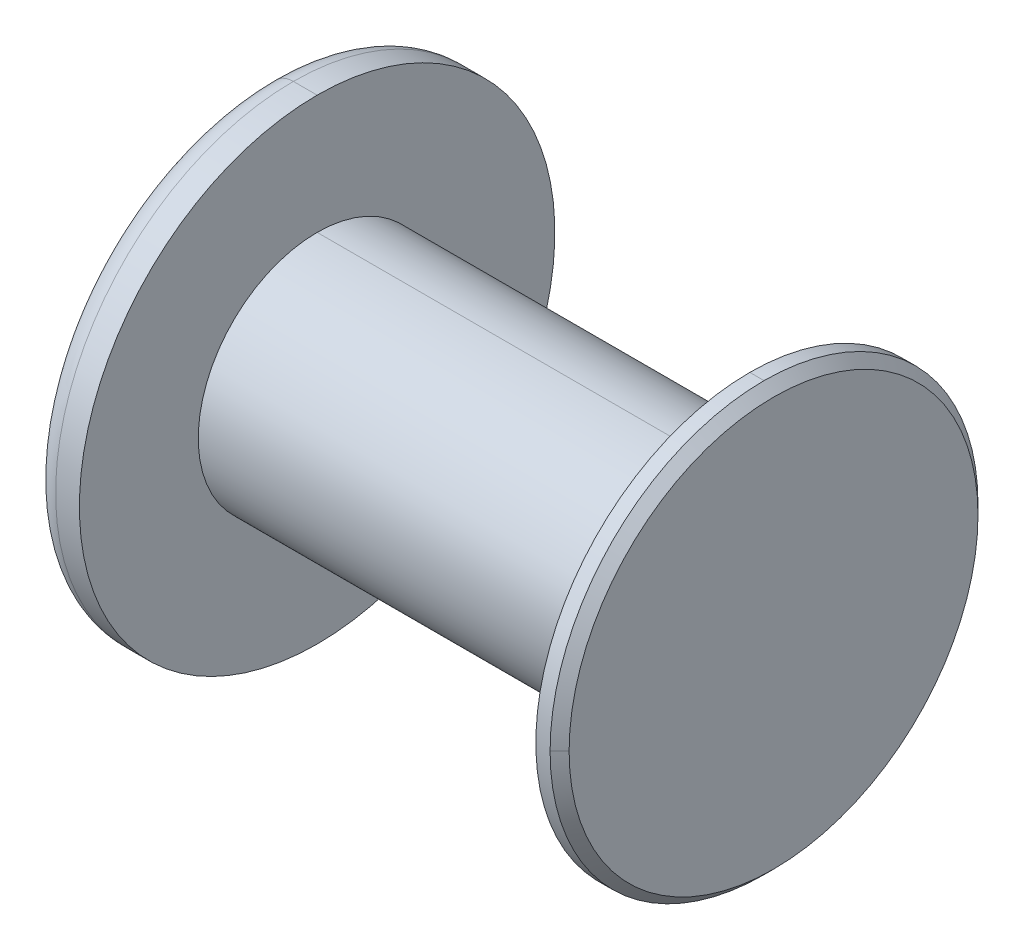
ISO-10303-21;
HEADER;
FILE_DESCRIPTION(('STEP AP214'),'2;1');
FILE_NAME('part.step','',(''),(''),'','','');
FILE_SCHEMA(('AUTOMOTIVE_DESIGN { 1 0 10303 214 1 1 1 1 }'));
ENDSEC;
DATA;
#1=APPLICATION_CONTEXT('core data for automotive mechanical design processes');
#2=APPLICATION_PROTOCOL_DEFINITION('international standard','automotive_design',2000,#1);
#3=PRODUCT_CONTEXT('',#1,'mechanical');
#4=PRODUCT('Part','Part','',(#3));
#5=PRODUCT_RELATED_PRODUCT_CATEGORY('part','',(#4));
#6=PRODUCT_DEFINITION_FORMATION('','',#4);
#7=PRODUCT_DEFINITION_CONTEXT('part definition',#1,'design');
#8=PRODUCT_DEFINITION('design','',#6,#7);
#9=PRODUCT_DEFINITION_SHAPE('','',#8);
#10=(LENGTH_UNIT() NAMED_UNIT(*) SI_UNIT(.MILLI.,.METRE.));
#11=(NAMED_UNIT(*) PLANE_ANGLE_UNIT() SI_UNIT($,.RADIAN.));
#12=(NAMED_UNIT(*) SI_UNIT($,.STERADIAN.) SOLID_ANGLE_UNIT());
#13=UNCERTAINTY_MEASURE_WITH_UNIT(LENGTH_MEASURE(1.E-05),#10,'distance_accuracy_value','');
#14=(GEOMETRIC_REPRESENTATION_CONTEXT(3) GLOBAL_UNCERTAINTY_ASSIGNED_CONTEXT((#13)) GLOBAL_UNIT_ASSIGNED_CONTEXT((#10,
#11,#12)) REPRESENTATION_CONTEXT('',''));
#15=CARTESIAN_POINT('',(0.,0.,0.));
#16=DIRECTION('',(0.,0.,1.));
#17=DIRECTION('',(1.,0.,0.));
#18=AXIS2_PLACEMENT_3D('',#15,#16,#17);
#19=CARTESIAN_POINT('',(5.1,0.,0.));
#20=DIRECTION('',(-1.,0.,0.));
#21=DIRECTION('',(0.,0.,1.));
#22=AXIS2_PLACEMENT_3D('',#19,#20,#21);
#23=CONICAL_SURFACE('',#22,4.5,0.785398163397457);
#24=DIRECTION('',(-0.707106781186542,0.,-0.707106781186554));
#25=VECTOR('',#24,1.);
#26=CARTESIAN_POINT('',(5.1,0.,-4.5));
#27=LINE('',#26,#25);
#28=CARTESIAN_POINT('',(5.3,0.,-4.3));
#29=VERTEX_POINT('',#28);
#30=CARTESIAN_POINT('',(5.1,0.,-4.5));
#31=VERTEX_POINT('',#30);
#32=EDGE_CURVE('E157',#29,#31,#27,.T.);
#33=ORIENTED_EDGE('',*,*,#32,.F.);
#34=CARTESIAN_POINT('',(5.3,0.,0.));
#35=DIRECTION('',(1.,0.,0.));
#36=DIRECTION('',(0.,-1.,0.));
#37=AXIS2_PLACEMENT_3D('',#34,#35,#36);
#38=CIRCLE('',#37,4.3);
#39=CARTESIAN_POINT('',(5.3,0.,4.3));
#40=VERTEX_POINT('',#39);
#41=EDGE_CURVE('E166',#40,#29,#38,.T.);
#42=ORIENTED_EDGE('',*,*,#41,.F.);
#43=DIRECTION('',(-0.707106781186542,0.,0.707106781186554));
#44=VECTOR('',#43,1.);
#45=CARTESIAN_POINT('',(5.1,0.,4.5));
#46=LINE('',#45,#44);
#47=CARTESIAN_POINT('',(5.1,0.,4.5));
#48=VERTEX_POINT('',#47);
#49=EDGE_CURVE('E156',#40,#48,#46,.T.);
#50=ORIENTED_EDGE('',*,*,#49,.T.);
#51=CARTESIAN_POINT('',(5.1,0.,0.));
#52=DIRECTION('',(-1.,0.,0.));
#53=DIRECTION('',(0.,0.,1.));
#54=AXIS2_PLACEMENT_3D('',#51,#52,#53);
#55=CIRCLE('',#54,4.5);
#56=CARTESIAN_POINT('',(5.1,-4.5,0.));
#57=VERTEX_POINT('',#56);
#58=EDGE_CURVE('E134',#57,#48,#55,.T.);
#59=ORIENTED_EDGE('',*,*,#58,.F.);
#60=CARTESIAN_POINT('',(5.1,0.,0.));
#61=DIRECTION('',(-1.,0.,0.));
#62=DIRECTION('',(0.,0.,1.));
#63=AXIS2_PLACEMENT_3D('',#60,#61,#62);
#64=CIRCLE('',#63,4.5);
#65=EDGE_CURVE('E11',#31,#57,#64,.T.);
#66=ORIENTED_EDGE('',*,*,#65,.F.);
#67=EDGE_LOOP('',(#33,#42,#50,#59,#66));
#68=FACE_BOUND('',#67,.T.);
#69=ADVANCED_FACE('F17',(#68),#23,.T.);
#70=CARTESIAN_POINT('',(-4.8,0.,0.));
#71=DIRECTION('',(1.,0.,0.));
#72=DIRECTION('',(0.,1.,0.));
#73=AXIS2_PLACEMENT_3D('',#70,#71,#72);
#74=TOROIDAL_SURFACE('',#73,4.5,0.5);
#75=CARTESIAN_POINT('',(-4.8,-4.5,0.));
#76=DIRECTION('',(0.,0.,1.));
#77=DIRECTION('',(0.,-1.,0.));
#78=AXIS2_PLACEMENT_3D('',#75,#76,#77);
#79=CIRCLE('',#78,0.5);
#80=CARTESIAN_POINT('',(-5.3,-4.5,0.));
#81=VERTEX_POINT('',#80);
#82=CARTESIAN_POINT('',(-4.8,-5.,0.));
#83=VERTEX_POINT('',#82);
#84=EDGE_CURVE('E155',#81,#83,#79,.T.);
#85=ORIENTED_EDGE('',*,*,#84,.F.);
#86=CARTESIAN_POINT('',(-5.3,0.,0.));
#87=DIRECTION('',(-1.,0.,0.));
#88=DIRECTION('',(0.,1.,0.));
#89=AXIS2_PLACEMENT_3D('',#86,#87,#88);
#90=CIRCLE('',#89,4.5);
#91=CARTESIAN_POINT('',(-5.3,4.5,0.));
#92=VERTEX_POINT('',#91);
#93=EDGE_CURVE('E163',#92,#81,#90,.T.);
#94=ORIENTED_EDGE('',*,*,#93,.F.);
#95=CARTESIAN_POINT('',(-4.8,4.5,0.));
#96=DIRECTION('',(0.,0.,-1.));
#97=DIRECTION('',(-1.,0.,0.));
#98=AXIS2_PLACEMENT_3D('',#95,#96,#97);
#99=CIRCLE('',#98,0.5);
#100=CARTESIAN_POINT('',(-4.8,5.,0.));
#101=VERTEX_POINT('',#100);
#102=EDGE_CURVE('E140',#92,#101,#99,.T.);
#103=ORIENTED_EDGE('',*,*,#102,.T.);
#104=CARTESIAN_POINT('',(-4.8,0.,0.));
#105=DIRECTION('',(1.,0.,0.));
#106=DIRECTION('',(0.,1.,0.));
#107=AXIS2_PLACEMENT_3D('',#104,#105,#106);
#108=CIRCLE('',#107,5.);
#109=EDGE_CURVE('E206',#83,#101,#108,.T.);
#110=ORIENTED_EDGE('',*,*,#109,.F.);
#111=EDGE_LOOP('',(#85,#94,#103,#110));
#112=FACE_BOUND('',#111,.T.);
#113=ADVANCED_FACE('F205',(#112),#74,.T.);
#114=CARTESIAN_POINT('',(-5.3,0.,0.));
#115=DIRECTION('',(-1.,0.,0.));
#116=DIRECTION('',(0.,-1.,0.));
#117=AXIS2_PLACEMENT_3D('',#114,#115,#116);
#118=CYLINDRICAL_SURFACE('',#117,4.5);
#119=DIRECTION('',(-1.,0.,0.));
#120=VECTOR('',#119,1.);
#121=CARTESIAN_POINT('',(-5.3,4.5,0.));
#122=LINE('',#121,#120);
#123=CARTESIAN_POINT('',(5.1,4.5,0.));
#124=VERTEX_POINT('',#123);
#125=CARTESIAN_POINT('',(4.8,4.5,0.));
#126=VERTEX_POINT('',#125);
#127=EDGE_CURVE('E117',#124,#126,#122,.T.);
#128=ORIENTED_EDGE('',*,*,#127,.F.);
#129=CARTESIAN_POINT('',(5.1,0.,0.));
#130=DIRECTION('',(-1.,0.,0.));
#131=DIRECTION('',(0.,0.,1.));
#132=AXIS2_PLACEMENT_3D('',#129,#130,#131);
#133=CIRCLE('',#132,4.5);
#134=EDGE_CURVE('E161',#124,#31,#133,.T.);
#135=ORIENTED_EDGE('',*,*,#134,.T.);
#136=ORIENTED_EDGE('',*,*,#65,.T.);
#137=DIRECTION('',(-1.,0.,0.));
#138=VECTOR('',#137,1.);
#139=CARTESIAN_POINT('',(-5.3,-4.5,0.));
#140=LINE('',#139,#138);
#141=CARTESIAN_POINT('',(4.8,-4.5,0.));
#142=VERTEX_POINT('',#141);
#143=EDGE_CURVE('E119',#57,#142,#140,.T.);
#144=ORIENTED_EDGE('',*,*,#143,.T.);
#145=CARTESIAN_POINT('',(4.8,0.,0.));
#146=DIRECTION('',(-1.,0.,0.));
#147=DIRECTION('',(0.,-1.,0.));
#148=AXIS2_PLACEMENT_3D('',#145,#146,#147);
#149=CIRCLE('',#148,4.5);
#150=EDGE_CURVE('E28',#126,#142,#149,.T.);
#151=ORIENTED_EDGE('',*,*,#150,.F.);
#152=EDGE_LOOP('',(#128,#135,#136,#144,#151));
#153=FACE_BOUND('',#152,.T.);
#154=ADVANCED_FACE('F115',(#153),#118,.T.);
#155=CARTESIAN_POINT('',(4.8,2.5,0.));
#156=DIRECTION('',(1.,0.,0.));
#157=DIRECTION('',(0.,-1.,0.));
#158=AXIS2_PLACEMENT_3D('',#155,#156,#157);
#159=PLANE('',#158);
#160=CARTESIAN_POINT('',(4.8,0.,0.));
#161=DIRECTION('',(-1.,0.,0.));
#162=DIRECTION('',(0.,-1.,0.));
#163=AXIS2_PLACEMENT_3D('',#160,#161,#162);
#164=CIRCLE('',#163,2.5);
#165=CARTESIAN_POINT('',(4.8,-2.5,0.));
#166=VERTEX_POINT('',#165);
#167=CARTESIAN_POINT('',(4.8,2.5,0.));
#168=VERTEX_POINT('',#167);
#169=EDGE_CURVE('E175',#166,#168,#164,.T.);
#170=ORIENTED_EDGE('',*,*,#169,.F.);
#171=CARTESIAN_POINT('',(4.8,0.,0.));
#172=DIRECTION('',(-1.,0.,0.));
#173=DIRECTION('',(0.,-1.,0.));
#174=AXIS2_PLACEMENT_3D('',#171,#172,#173);
#175=CIRCLE('',#174,2.5);
#176=EDGE_CURVE('E21',#168,#166,#175,.T.);
#177=ORIENTED_EDGE('',*,*,#176,.F.);
#178=EDGE_LOOP('',(#170,#177));
#179=FACE_BOUND('',#178,.T.);
#180=CARTESIAN_POINT('',(4.8,0.,0.));
#181=DIRECTION('',(-1.,0.,0.));
#182=DIRECTION('',(0.,-1.,0.));
#183=AXIS2_PLACEMENT_3D('',#180,#181,#182);
#184=CIRCLE('',#183,4.5);
#185=EDGE_CURVE('E124',#142,#126,#184,.T.);
#186=ORIENTED_EDGE('',*,*,#185,.T.);
#187=ORIENTED_EDGE('',*,*,#150,.T.);
#188=EDGE_LOOP('',(#186,#187));
#189=FACE_BOUND('',#188,.T.);
#190=ADVANCED_FACE('F125',(#179,#189),#159,.F.);
#191=CARTESIAN_POINT('',(-5.3,0.,0.));
#192=DIRECTION('',(-1.,0.,0.));
#193=DIRECTION('',(0.,-1.,0.));
#194=AXIS2_PLACEMENT_3D('',#191,#192,#193);
#195=CYLINDRICAL_SURFACE('',#194,2.5);
#196=DIRECTION('',(-1.,0.,0.));
#197=VECTOR('',#196,1.);
#198=CARTESIAN_POINT('',(-5.3,2.5,0.));
#199=LINE('',#198,#197);
#200=CARTESIAN_POINT('',(-4.3,2.5,0.));
#201=VERTEX_POINT('',#200);
#202=EDGE_CURVE('E150',#168,#201,#199,.T.);
#203=ORIENTED_EDGE('',*,*,#202,.F.);
#204=ORIENTED_EDGE('',*,*,#176,.T.);
#205=DIRECTION('',(-1.,0.,0.));
#206=VECTOR('',#205,1.);
#207=CARTESIAN_POINT('',(-5.3,-2.5,0.));
#208=LINE('',#207,#206);
#209=CARTESIAN_POINT('',(-4.3,-2.5,0.));
#210=VERTEX_POINT('',#209);
#211=EDGE_CURVE('E149',#166,#210,#208,.T.);
#212=ORIENTED_EDGE('',*,*,#211,.T.);
#213=CARTESIAN_POINT('',(-4.3,0.,0.));
#214=DIRECTION('',(-1.,0.,0.));
#215=DIRECTION('',(0.,-1.,0.));
#216=AXIS2_PLACEMENT_3D('',#213,#214,#215);
#217=CIRCLE('',#216,2.5);
#218=EDGE_CURVE('E209',#201,#210,#217,.T.);
#219=ORIENTED_EDGE('',*,*,#218,.F.);
#220=EDGE_LOOP('',(#203,#204,#212,#219));
#221=FACE_BOUND('',#220,.T.);
#222=ADVANCED_FACE('F242',(#221),#195,.T.);
#223=CARTESIAN_POINT('',(-4.3,5.,0.));
#224=DIRECTION('',(-1.,0.,0.));
#225=DIRECTION('',(0.,0.,1.));
#226=AXIS2_PLACEMENT_3D('',#223,#224,#225);
#227=PLANE('',#226);
#228=CARTESIAN_POINT('',(-4.3,0.,0.));
#229=DIRECTION('',(-1.,0.,0.));
#230=DIRECTION('',(0.,-1.,0.));
#231=AXIS2_PLACEMENT_3D('',#228,#229,#230);
#232=CIRCLE('',#231,2.5);
#233=EDGE_CURVE('E145',#210,#201,#232,.T.);
#234=ORIENTED_EDGE('',*,*,#233,.T.);
#235=ORIENTED_EDGE('',*,*,#218,.T.);
#236=EDGE_LOOP('',(#234,#235));
#237=FACE_BOUND('',#236,.T.);
#238=CARTESIAN_POINT('',(-4.3,0.,0.));
#239=DIRECTION('',(-1.,0.,0.));
#240=DIRECTION('',(0.,-1.,0.));
#241=AXIS2_PLACEMENT_3D('',#238,#239,#240);
#242=CIRCLE('',#241,5.);
#243=CARTESIAN_POINT('',(-4.3,-5.,0.));
#244=VERTEX_POINT('',#243);
#245=CARTESIAN_POINT('',(-4.3,5.,0.));
#246=VERTEX_POINT('',#245);
#247=EDGE_CURVE('E172',#244,#246,#242,.T.);
#248=ORIENTED_EDGE('',*,*,#247,.F.);
#249=CARTESIAN_POINT('',(-4.3,0.,0.));
#250=DIRECTION('',(-1.,0.,0.));
#251=DIRECTION('',(0.,-1.,0.));
#252=AXIS2_PLACEMENT_3D('',#249,#250,#251);
#253=CIRCLE('',#252,5.);
#254=EDGE_CURVE('E42',#246,#244,#253,.T.);
#255=ORIENTED_EDGE('',*,*,#254,.F.);
#256=EDGE_LOOP('',(#248,#255));
#257=FACE_BOUND('',#256,.T.);
#258=ADVANCED_FACE('F240',(#237,#257),#227,.F.);
#259=CARTESIAN_POINT('',(-5.3,0.,0.));
#260=DIRECTION('',(-1.,0.,0.));
#261=DIRECTION('',(0.,-1.,0.));
#262=AXIS2_PLACEMENT_3D('',#259,#260,#261);
#263=CYLINDRICAL_SURFACE('',#262,5.);
#264=DIRECTION('',(-1.,0.,0.));
#265=VECTOR('',#264,1.);
#266=CARTESIAN_POINT('',(-5.3,5.,0.));
#267=LINE('',#266,#265);
#268=EDGE_CURVE('E167',#246,#101,#267,.T.);
#269=ORIENTED_EDGE('',*,*,#268,.F.);
#270=ORIENTED_EDGE('',*,*,#254,.T.);
#271=DIRECTION('',(-1.,0.,0.));
#272=VECTOR('',#271,1.);
#273=CARTESIAN_POINT('',(-5.3,-5.,0.));
#274=LINE('',#273,#272);
#275=EDGE_CURVE('E171',#244,#83,#274,.T.);
#276=ORIENTED_EDGE('',*,*,#275,.T.);
#277=ORIENTED_EDGE('',*,*,#109,.T.);
#278=EDGE_LOOP('',(#269,#270,#276,#277));
#279=FACE_BOUND('',#278,.T.);
#280=ADVANCED_FACE('F211',(#279),#263,.T.);
#281=CARTESIAN_POINT('',(-5.3,0.,0.));
#282=DIRECTION('',(1.,0.,0.));
#283=DIRECTION('',(0.,-1.,0.));
#284=AXIS2_PLACEMENT_3D('',#281,#282,#283);
#285=PLANE('',#284);
#286=ORIENTED_EDGE('',*,*,#93,.T.);
#287=CARTESIAN_POINT('',(-5.3,0.,0.));
#288=DIRECTION('',(-1.,0.,0.));
#289=DIRECTION('',(0.,1.,0.));
#290=AXIS2_PLACEMENT_3D('',#287,#288,#289);
#291=CIRCLE('',#290,4.5);
#292=EDGE_CURVE('E151',#81,#92,#291,.T.);
#293=ORIENTED_EDGE('',*,*,#292,.T.);
#294=EDGE_LOOP('',(#286,#293));
#295=FACE_BOUND('',#294,.T.);
#296=ADVANCED_FACE('F19',(#295),#285,.F.);
#297=CARTESIAN_POINT('',(5.3,4.5,0.));
#298=DIRECTION('',(-1.,0.,0.));
#299=DIRECTION('',(0.,0.,1.));
#300=AXIS2_PLACEMENT_3D('',#297,#298,#299);
#301=PLANE('',#300);
#302=ORIENTED_EDGE('',*,*,#41,.T.);
#303=CARTESIAN_POINT('',(5.3,0.,0.));
#304=DIRECTION('',(1.,0.,0.));
#305=DIRECTION('',(0.,-1.,0.));
#306=AXIS2_PLACEMENT_3D('',#303,#304,#305);
#307=CIRCLE('',#306,4.3);
#308=EDGE_CURVE('E162',#29,#40,#307,.T.);
#309=ORIENTED_EDGE('',*,*,#308,.T.);
#310=EDGE_LOOP('',(#302,#309));
#311=FACE_BOUND('',#310,.T.);
#312=ADVANCED_FACE('F269',(#311),#301,.F.);
#313=CARTESIAN_POINT('',(-5.3,0.,0.));
#314=DIRECTION('',(-1.,0.,0.));
#315=DIRECTION('',(0.,-1.,0.));
#316=AXIS2_PLACEMENT_3D('',#313,#314,#315);
#317=CYLINDRICAL_SURFACE('',#316,5.);
#318=ORIENTED_EDGE('',*,*,#247,.T.);
#319=ORIENTED_EDGE('',*,*,#268,.T.);
#320=CARTESIAN_POINT('',(-4.8,0.,0.));
#321=DIRECTION('',(1.,0.,0.));
#322=DIRECTION('',(0.,1.,0.));
#323=AXIS2_PLACEMENT_3D('',#320,#321,#322);
#324=CIRCLE('',#323,5.);
#325=EDGE_CURVE('E142',#101,#83,#324,.T.);
#326=ORIENTED_EDGE('',*,*,#325,.T.);
#327=ORIENTED_EDGE('',*,*,#275,.F.);
#328=EDGE_LOOP('',(#318,#319,#326,#327));
#329=FACE_BOUND('',#328,.T.);
#330=ADVANCED_FACE('F199',(#329),#317,.T.);
#331=CARTESIAN_POINT('',(-5.3,0.,0.));
#332=DIRECTION('',(-1.,0.,0.));
#333=DIRECTION('',(0.,-1.,0.));
#334=AXIS2_PLACEMENT_3D('',#331,#332,#333);
#335=CYLINDRICAL_SURFACE('',#334,2.5);
#336=ORIENTED_EDGE('',*,*,#169,.T.);
#337=ORIENTED_EDGE('',*,*,#202,.T.);
#338=ORIENTED_EDGE('',*,*,#233,.F.);
#339=ORIENTED_EDGE('',*,*,#211,.F.);
#340=EDGE_LOOP('',(#336,#337,#338,#339));
#341=FACE_BOUND('',#340,.T.);
#342=ADVANCED_FACE('F268',(#341),#335,.T.);
#343=CARTESIAN_POINT('',(-5.3,0.,0.));
#344=DIRECTION('',(-1.,0.,0.));
#345=DIRECTION('',(0.,-1.,0.));
#346=AXIS2_PLACEMENT_3D('',#343,#344,#345);
#347=CYLINDRICAL_SURFACE('',#346,4.5);
#348=ORIENTED_EDGE('',*,*,#58,.T.);
#349=CARTESIAN_POINT('',(5.1,0.,0.));
#350=DIRECTION('',(-1.,0.,0.));
#351=DIRECTION('',(0.,0.,1.));
#352=AXIS2_PLACEMENT_3D('',#349,#350,#351);
#353=CIRCLE('',#352,4.5);
#354=EDGE_CURVE('E131',#48,#124,#353,.T.);
#355=ORIENTED_EDGE('',*,*,#354,.T.);
#356=ORIENTED_EDGE('',*,*,#127,.T.);
#357=ORIENTED_EDGE('',*,*,#185,.F.);
#358=ORIENTED_EDGE('',*,*,#143,.F.);
#359=EDGE_LOOP('',(#348,#355,#356,#357,#358));
#360=FACE_BOUND('',#359,.T.);
#361=ADVANCED_FACE('F129',(#360),#347,.T.);
#362=CARTESIAN_POINT('',(-4.8,0.,0.));
#363=DIRECTION('',(1.,0.,0.));
#364=DIRECTION('',(0.,1.,0.));
#365=AXIS2_PLACEMENT_3D('',#362,#363,#364);
#366=TOROIDAL_SURFACE('',#365,4.5,0.5);
#367=ORIENTED_EDGE('',*,*,#292,.F.);
#368=ORIENTED_EDGE('',*,*,#84,.T.);
#369=ORIENTED_EDGE('',*,*,#325,.F.);
#370=ORIENTED_EDGE('',*,*,#102,.F.);
#371=EDGE_LOOP('',(#367,#368,#369,#370));
#372=FACE_BOUND('',#371,.T.);
#373=ADVANCED_FACE('F204',(#372),#366,.T.);
#374=CARTESIAN_POINT('',(5.1,0.,0.));
#375=DIRECTION('',(-1.,0.,0.));
#376=DIRECTION('',(0.,0.,1.));
#377=AXIS2_PLACEMENT_3D('',#374,#375,#376);
#378=CONICAL_SURFACE('',#377,4.5,0.785398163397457);
#379=ORIENTED_EDGE('',*,*,#308,.F.);
#380=ORIENTED_EDGE('',*,*,#32,.T.);
#381=ORIENTED_EDGE('',*,*,#134,.F.);
#382=ORIENTED_EDGE('',*,*,#354,.F.);
#383=ORIENTED_EDGE('',*,*,#49,.F.);
#384=EDGE_LOOP('',(#379,#380,#381,#382,#383));
#385=FACE_BOUND('',#384,.T.);
#386=ADVANCED_FACE('F266',(#385),#378,.T.);
#387=CLOSED_SHELL('',(#69,#113,#154,#190,#222,#258,#280,#296,#312,#330,#342,#361,#373,#386));
#388=MANIFOLD_SOLID_BREP('B1',#387);
#389=ADVANCED_BREP_SHAPE_REPRESENTATION('',(#18,#388),#14);
#390=SHAPE_DEFINITION_REPRESENTATION(#9,#389);
ENDSEC;
END-ISO-10303-21;
